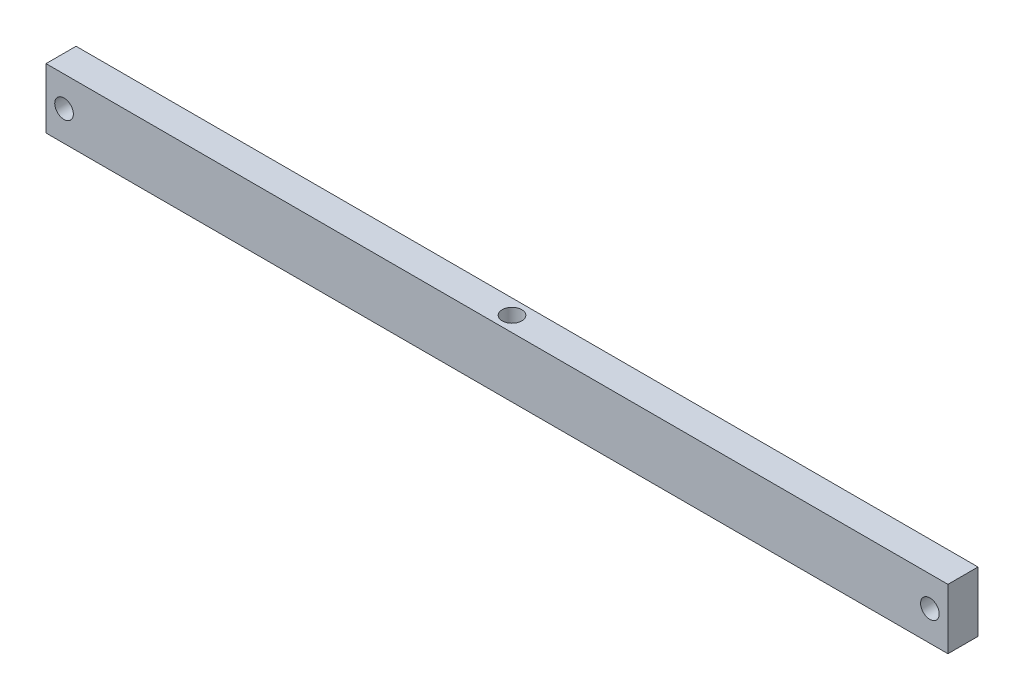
ISO-10303-21;
HEADER;
FILE_DESCRIPTION(('STEP AP214'),'2;1');
FILE_NAME('part.step','',(''),(''),'','','');
FILE_SCHEMA(('AUTOMOTIVE_DESIGN { 1 0 10303 214 1 1 1 1 }'));
ENDSEC;
DATA;
#1=APPLICATION_CONTEXT('core data for automotive mechanical design processes');
#2=APPLICATION_PROTOCOL_DEFINITION('international standard','automotive_design',2000,#1);
#3=PRODUCT_CONTEXT('',#1,'mechanical');
#4=PRODUCT('Part','Part','',(#3));
#5=PRODUCT_RELATED_PRODUCT_CATEGORY('part','',(#4));
#6=PRODUCT_DEFINITION_FORMATION('','',#4);
#7=PRODUCT_DEFINITION_CONTEXT('part definition',#1,'design');
#8=PRODUCT_DEFINITION('design','',#6,#7);
#9=PRODUCT_DEFINITION_SHAPE('','',#8);
#10=(LENGTH_UNIT() NAMED_UNIT(*) SI_UNIT(.MILLI.,.METRE.));
#11=(NAMED_UNIT(*) PLANE_ANGLE_UNIT() SI_UNIT($,.RADIAN.));
#12=(NAMED_UNIT(*) SI_UNIT($,.STERADIAN.) SOLID_ANGLE_UNIT());
#13=UNCERTAINTY_MEASURE_WITH_UNIT(LENGTH_MEASURE(1.E-05),#10,'distance_accuracy_value','');
#14=(GEOMETRIC_REPRESENTATION_CONTEXT(3) GLOBAL_UNCERTAINTY_ASSIGNED_CONTEXT((#13)) GLOBAL_UNIT_ASSIGNED_CONTEXT((#10,
#11,#12)) REPRESENTATION_CONTEXT('',''));
#15=CARTESIAN_POINT('',(0.,0.,0.));
#16=DIRECTION('',(0.,0.,1.));
#17=DIRECTION('',(1.,0.,0.));
#18=AXIS2_PLACEMENT_3D('',#15,#16,#17);
#19=CARTESIAN_POINT('',(-1.11022302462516E-13,0.,5.));
#20=DIRECTION('',(0.,0.,0.999999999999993));
#21=DIRECTION('',(1.,0.,0.));
#22=AXIS2_PLACEMENT_3D('',#19,#20,#21);
#23=PLANE('',#22);
#24=CARTESIAN_POINT('',(6.00000000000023,10.0000000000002,5.));
#25=DIRECTION('',(0.,0.,0.999999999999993));
#26=DIRECTION('',(1.,0.,0.));
#27=AXIS2_PLACEMENT_3D('',#24,#25,#26);
#28=CIRCLE('',#27,3.1);
#29=CARTESIAN_POINT('',(2.90000000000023,10.0000000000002,5.));
#30=VERTEX_POINT('',#29);
#31=EDGE_CURVE('E98',#30,#30,#28,.T.);
#32=ORIENTED_EDGE('',*,*,#31,.F.);
#33=EDGE_LOOP('',(#32));
#34=FACE_BOUND('',#33,.T.);
#35=DIRECTION('',(0.,-1.,0.));
#36=VECTOR('',#35,1.);
#37=CARTESIAN_POINT('',(2.22044604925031E-13,20.,5.));
#38=LINE('',#37,#36);
#39=CARTESIAN_POINT('',(2.22044604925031E-13,20.,5.));
#40=VERTEX_POINT('',#39);
#41=CARTESIAN_POINT('',(-1.11022302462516E-13,0.,5.));
#42=VERTEX_POINT('',#41);
#43=EDGE_CURVE('E113',#40,#42,#38,.T.);
#44=ORIENTED_EDGE('',*,*,#43,.T.);
#45=DIRECTION('',(1.,0.,0.));
#46=VECTOR('',#45,1.);
#47=CARTESIAN_POINT('',(-1.11022302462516E-13,0.,5.));
#48=LINE('',#47,#46);
#49=CARTESIAN_POINT('',(300.,0.,5.00000000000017));
#50=VERTEX_POINT('',#49);
#51=EDGE_CURVE('E92',#42,#50,#48,.T.);
#52=ORIENTED_EDGE('',*,*,#51,.T.);
#53=DIRECTION('',(0.,1.,0.));
#54=VECTOR('',#53,1.);
#55=CARTESIAN_POINT('',(300.,0.,5.00000000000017));
#56=LINE('',#55,#54);
#57=CARTESIAN_POINT('',(300.,20.0000000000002,5.00000000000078));
#58=VERTEX_POINT('',#57);
#59=EDGE_CURVE('E57',#50,#58,#56,.T.);
#60=ORIENTED_EDGE('',*,*,#59,.T.);
#61=DIRECTION('',(-1.,0.,0.));
#62=VECTOR('',#61,1.);
#63=CARTESIAN_POINT('',(300.,20.0000000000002,5.00000000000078));
#64=LINE('',#63,#62);
#65=EDGE_CURVE('E52',#58,#40,#64,.T.);
#66=ORIENTED_EDGE('',*,*,#65,.T.);
#67=EDGE_LOOP('',(#44,#52,#60,#66));
#68=FACE_BOUND('',#67,.T.);
#69=CARTESIAN_POINT('',(294.,10.0000000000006,5.00000000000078));
#70=DIRECTION('',(0.,0.,0.999999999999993));
#71=DIRECTION('',(-1.,0.,0.));
#72=AXIS2_PLACEMENT_3D('',#69,#70,#71);
#73=CIRCLE('',#72,3.09999999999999);
#74=CARTESIAN_POINT('',(290.9,10.0000000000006,5.00000000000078));
#75=VERTEX_POINT('',#74);
#76=EDGE_CURVE('E137',#75,#75,#73,.T.);
#77=ORIENTED_EDGE('',*,*,#76,.F.);
#78=EDGE_LOOP('',(#77));
#79=FACE_BOUND('',#78,.T.);
#80=ADVANCED_FACE('F36',(#34,#68,#79),#23,.T.);
#81=CARTESIAN_POINT('',(-1.11022302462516E-13,0.,-5.));
#82=DIRECTION('',(0.,0.,0.999999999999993));
#83=DIRECTION('',(1.,0.,0.));
#84=AXIS2_PLACEMENT_3D('',#81,#82,#83);
#85=PLANE('',#84);
#86=CARTESIAN_POINT('',(6.00000000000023,10.0000000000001,-5.));
#87=DIRECTION('',(0.,0.,0.999999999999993));
#88=DIRECTION('',(1.,0.,0.));
#89=AXIS2_PLACEMENT_3D('',#86,#87,#88);
#90=CIRCLE('',#89,3.1);
#91=CARTESIAN_POINT('',(2.90000000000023,10.0000000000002,-5.));
#92=VERTEX_POINT('',#91);
#93=EDGE_CURVE('E104',#92,#92,#90,.T.);
#94=ORIENTED_EDGE('',*,*,#93,.T.);
#95=EDGE_LOOP('',(#94));
#96=FACE_BOUND('',#95,.T.);
#97=DIRECTION('',(0.,-1.,0.));
#98=VECTOR('',#97,1.);
#99=CARTESIAN_POINT('',(2.22044604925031E-13,20.,-5.));
#100=LINE('',#99,#98);
#101=CARTESIAN_POINT('',(2.22044604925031E-13,20.,-5.));
#102=VERTEX_POINT('',#101);
#103=CARTESIAN_POINT('',(-1.11022302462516E-13,0.,-5.));
#104=VERTEX_POINT('',#103);
#105=EDGE_CURVE('E83',#102,#104,#100,.T.);
#106=ORIENTED_EDGE('',*,*,#105,.F.);
#107=DIRECTION('',(-1.,0.,0.));
#108=VECTOR('',#107,1.);
#109=CARTESIAN_POINT('',(300.,20.0000000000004,-4.99999999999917));
#110=LINE('',#109,#108);
#111=CARTESIAN_POINT('',(300.,20.0000000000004,-4.99999999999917));
#112=VERTEX_POINT('',#111);
#113=EDGE_CURVE('E110',#112,#102,#110,.T.);
#114=ORIENTED_EDGE('',*,*,#113,.F.);
#115=DIRECTION('',(0.,1.,0.));
#116=VECTOR('',#115,1.);
#117=CARTESIAN_POINT('',(300.,0.,-4.99999999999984));
#118=LINE('',#117,#116);
#119=CARTESIAN_POINT('',(300.,0.,-4.99999999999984));
#120=VERTEX_POINT('',#119);
#121=EDGE_CURVE('E84',#120,#112,#118,.T.);
#122=ORIENTED_EDGE('',*,*,#121,.F.);
#123=DIRECTION('',(1.,0.,0.));
#124=VECTOR('',#123,1.);
#125=CARTESIAN_POINT('',(-1.11022302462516E-13,0.,-5.));
#126=LINE('',#125,#124);
#127=EDGE_CURVE('E78',#104,#120,#126,.T.);
#128=ORIENTED_EDGE('',*,*,#127,.F.);
#129=EDGE_LOOP('',(#106,#114,#122,#128));
#130=FACE_BOUND('',#129,.T.);
#131=CARTESIAN_POINT('',(294.,10.0000000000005,-4.99999999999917));
#132=DIRECTION('',(0.,0.,0.999999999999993));
#133=DIRECTION('',(-1.,0.,0.));
#134=AXIS2_PLACEMENT_3D('',#131,#132,#133);
#135=CIRCLE('',#134,3.09999999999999);
#136=CARTESIAN_POINT('',(290.9,10.0000000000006,-4.99999999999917));
#137=VERTEX_POINT('',#136);
#138=EDGE_CURVE('E140',#137,#137,#135,.T.);
#139=ORIENTED_EDGE('',*,*,#138,.T.);
#140=EDGE_LOOP('',(#139));
#141=FACE_BOUND('',#140,.T.);
#142=ADVANCED_FACE('F79',(#96,#130,#141),#85,.F.);
#143=CARTESIAN_POINT('',(2.22044604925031E-13,20.,5.));
#144=DIRECTION('',(1.,0.,0.));
#145=DIRECTION('',(0.,1.,0.));
#146=AXIS2_PLACEMENT_3D('',#143,#144,#145);
#147=PLANE('',#146);
#148=ORIENTED_EDGE('',*,*,#105,.T.);
#149=DIRECTION('',(0.,0.,-0.999999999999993));
#150=VECTOR('',#149,1.);
#151=CARTESIAN_POINT('',(-1.11022302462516E-13,0.,5.));
#152=LINE('',#151,#150);
#153=EDGE_CURVE('E11',#42,#104,#152,.T.);
#154=ORIENTED_EDGE('',*,*,#153,.F.);
#155=ORIENTED_EDGE('',*,*,#43,.F.);
#156=DIRECTION('',(0.,0.,-0.999999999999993));
#157=VECTOR('',#156,1.);
#158=CARTESIAN_POINT('',(2.22044604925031E-13,20.,5.));
#159=LINE('',#158,#157);
#160=EDGE_CURVE('E96',#40,#102,#159,.T.);
#161=ORIENTED_EDGE('',*,*,#160,.T.);
#162=EDGE_LOOP('',(#148,#154,#155,#161));
#163=FACE_BOUND('',#162,.T.);
#164=ADVANCED_FACE('F38',(#163),#147,.F.);
#165=CARTESIAN_POINT('',(-1.11022302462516E-13,0.,5.));
#166=DIRECTION('',(0.,1.,0.));
#167=DIRECTION('',(0.,0.,0.999999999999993));
#168=AXIS2_PLACEMENT_3D('',#165,#166,#167);
#169=PLANE('',#168);
#170=CARTESIAN_POINT('',(150.,-6.93889390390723E-13,0.));
#171=DIRECTION('',(0.,1.,0.));
#172=DIRECTION('',(0.,0.,0.999999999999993));
#173=AXIS2_PLACEMENT_3D('',#170,#171,#172);
#174=CIRCLE('',#173,3.25000000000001);
#175=CARTESIAN_POINT('',(150.,-6.93889390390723E-13,3.24999999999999));
#176=VERTEX_POINT('',#175);
#177=EDGE_CURVE('E146',#176,#176,#174,.F.);
#178=ORIENTED_EDGE('',*,*,#177,.F.);
#179=EDGE_LOOP('',(#178));
#180=FACE_BOUND('',#179,.T.);
#181=ORIENTED_EDGE('',*,*,#127,.T.);
#182=DIRECTION('',(0.,0.,-0.999999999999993));
#183=VECTOR('',#182,1.);
#184=CARTESIAN_POINT('',(300.,0.,5.00000000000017));
#185=LINE('',#184,#183);
#186=EDGE_CURVE('E45',#50,#120,#185,.T.);
#187=ORIENTED_EDGE('',*,*,#186,.F.);
#188=ORIENTED_EDGE('',*,*,#51,.F.);
#189=ORIENTED_EDGE('',*,*,#153,.T.);
#190=EDGE_LOOP('',(#181,#187,#188,#189));
#191=FACE_BOUND('',#190,.T.);
#192=ADVANCED_FACE('F91',(#180,#191),#169,.F.);
#193=CARTESIAN_POINT('',(300.,0.,5.00000000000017));
#194=DIRECTION('',(-1.,0.,0.));
#195=DIRECTION('',(0.,0.,0.999999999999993));
#196=AXIS2_PLACEMENT_3D('',#193,#194,#195);
#197=PLANE('',#196);
#198=ORIENTED_EDGE('',*,*,#121,.T.);
#199=DIRECTION('',(0.,0.,-0.999999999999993));
#200=VECTOR('',#199,1.);
#201=CARTESIAN_POINT('',(300.,20.0000000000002,5.00000000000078));
#202=LINE('',#201,#200);
#203=EDGE_CURVE('E124',#58,#112,#202,.T.);
#204=ORIENTED_EDGE('',*,*,#203,.F.);
#205=ORIENTED_EDGE('',*,*,#59,.F.);
#206=ORIENTED_EDGE('',*,*,#186,.T.);
#207=EDGE_LOOP('',(#198,#204,#205,#206));
#208=FACE_BOUND('',#207,.T.);
#209=ADVANCED_FACE('F128',(#208),#197,.F.);
#210=CARTESIAN_POINT('',(300.,20.0000000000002,5.00000000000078));
#211=DIRECTION('',(0.,-1.,0.));
#212=DIRECTION('',(0.,0.,-0.999999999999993));
#213=AXIS2_PLACEMENT_3D('',#210,#211,#212);
#214=PLANE('',#213);
#215=CARTESIAN_POINT('',(150.,20.0000000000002,8.32667268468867E-13));
#216=DIRECTION('',(0.,1.,0.));
#217=DIRECTION('',(0.,0.,0.999999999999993));
#218=AXIS2_PLACEMENT_3D('',#215,#216,#217);
#219=CIRCLE('',#218,3.25000000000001);
#220=CARTESIAN_POINT('',(150.,20.0000000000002,3.25000000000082));
#221=VERTEX_POINT('',#220);
#222=EDGE_CURVE('E151',#221,#221,#219,.T.);
#223=ORIENTED_EDGE('',*,*,#222,.F.);
#224=EDGE_LOOP('',(#223));
#225=FACE_BOUND('',#224,.T.);
#226=ORIENTED_EDGE('',*,*,#113,.T.);
#227=ORIENTED_EDGE('',*,*,#160,.F.);
#228=ORIENTED_EDGE('',*,*,#65,.F.);
#229=ORIENTED_EDGE('',*,*,#203,.T.);
#230=EDGE_LOOP('',(#226,#227,#228,#229));
#231=FACE_BOUND('',#230,.T.);
#232=ADVANCED_FACE('F130',(#225,#231),#214,.F.);
#233=CARTESIAN_POINT('',(6.00000000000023,10.0000000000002,5.));
#234=DIRECTION('',(0.,0.,-0.999999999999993));
#235=DIRECTION('',(-1.,0.,0.));
#236=AXIS2_PLACEMENT_3D('',#233,#234,#235);
#237=CYLINDRICAL_SURFACE('',#236,3.1);
#238=CARTESIAN_POINT('',(2.90000000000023,10.0000000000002,5.));
#239=CARTESIAN_POINT('',(2.90000000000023,10.0000000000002,4.89583333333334));
#240=CARTESIAN_POINT('',(2.90000000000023,10.0000000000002,4.79166666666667));
#241=CARTESIAN_POINT('',(2.90000000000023,10.0000000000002,4.58333333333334));
#242=CARTESIAN_POINT('',(2.90000000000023,10.0000000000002,4.47916666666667));
#243=CARTESIAN_POINT('',(2.90000000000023,10.0000000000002,4.27083333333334));
#244=CARTESIAN_POINT('',(2.90000000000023,10.0000000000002,4.16666666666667));
#245=CARTESIAN_POINT('',(2.90000000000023,10.0000000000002,3.95833333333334));
#246=CARTESIAN_POINT('',(2.90000000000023,10.0000000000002,3.85416666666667));
#247=CARTESIAN_POINT('',(2.90000000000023,10.0000000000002,3.64583333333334));
#248=CARTESIAN_POINT('',(2.90000000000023,10.0000000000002,3.54166666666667));
#249=CARTESIAN_POINT('',(2.90000000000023,10.0000000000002,3.33333333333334));
#250=CARTESIAN_POINT('',(2.90000000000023,10.0000000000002,3.22916666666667));
#251=CARTESIAN_POINT('',(2.90000000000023,10.0000000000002,3.02083333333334));
#252=CARTESIAN_POINT('',(2.90000000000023,10.0000000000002,2.91666666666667));
#253=CARTESIAN_POINT('',(2.90000000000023,10.0000000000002,2.70833333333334));
#254=CARTESIAN_POINT('',(2.90000000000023,10.0000000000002,2.60416666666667));
#255=CARTESIAN_POINT('',(2.90000000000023,10.0000000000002,2.39583333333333));
#256=CARTESIAN_POINT('',(2.90000000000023,10.0000000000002,2.29166666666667));
#257=CARTESIAN_POINT('',(2.90000000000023,10.0000000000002,2.08333333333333));
#258=CARTESIAN_POINT('',(2.90000000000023,10.0000000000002,1.97916666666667));
#259=CARTESIAN_POINT('',(2.90000000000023,10.0000000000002,1.77083333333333));
#260=CARTESIAN_POINT('',(2.90000000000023,10.0000000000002,1.66666666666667));
#261=CARTESIAN_POINT('',(2.90000000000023,10.0000000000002,1.45833333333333));
#262=CARTESIAN_POINT('',(2.90000000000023,10.0000000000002,1.35416666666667));
#263=CARTESIAN_POINT('',(2.90000000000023,10.0000000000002,1.14583333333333));
#264=CARTESIAN_POINT('',(2.90000000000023,10.0000000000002,1.04166666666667));
#265=CARTESIAN_POINT('',(2.90000000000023,10.0000000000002,0.833333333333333));
#266=CARTESIAN_POINT('',(2.90000000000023,10.0000000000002,0.729166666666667));
#267=CARTESIAN_POINT('',(2.90000000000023,10.0000000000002,0.520833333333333));
#268=CARTESIAN_POINT('',(2.90000000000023,10.0000000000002,0.416666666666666));
#269=CARTESIAN_POINT('',(2.90000000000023,10.0000000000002,0.208333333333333));
#270=CARTESIAN_POINT('',(2.90000000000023,10.0000000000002,0.104166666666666));
#271=CARTESIAN_POINT('',(2.90000000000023,10.0000000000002,-0.104166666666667));
#272=CARTESIAN_POINT('',(2.90000000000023,10.0000000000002,-0.208333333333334));
#273=CARTESIAN_POINT('',(2.90000000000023,10.0000000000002,-0.416666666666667));
#274=CARTESIAN_POINT('',(2.90000000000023,10.0000000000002,-0.520833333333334));
#275=CARTESIAN_POINT('',(2.90000000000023,10.0000000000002,-0.729166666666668));
#276=CARTESIAN_POINT('',(2.90000000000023,10.0000000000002,-0.833333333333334));
#277=CARTESIAN_POINT('',(2.90000000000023,10.0000000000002,-1.04166666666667));
#278=CARTESIAN_POINT('',(2.90000000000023,10.0000000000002,-1.14583333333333));
#279=CARTESIAN_POINT('',(2.90000000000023,10.0000000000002,-1.35416666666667));
#280=CARTESIAN_POINT('',(2.90000000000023,10.0000000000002,-1.45833333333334));
#281=CARTESIAN_POINT('',(2.90000000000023,10.0000000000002,-1.66666666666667));
#282=CARTESIAN_POINT('',(2.90000000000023,10.0000000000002,-1.77083333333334));
#283=CARTESIAN_POINT('',(2.90000000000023,10.0000000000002,-1.97916666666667));
#284=CARTESIAN_POINT('',(2.90000000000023,10.0000000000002,-2.08333333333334));
#285=CARTESIAN_POINT('',(2.90000000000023,10.0000000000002,-2.29166666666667));
#286=CARTESIAN_POINT('',(2.90000000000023,10.0000000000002,-2.39583333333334));
#287=CARTESIAN_POINT('',(2.90000000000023,10.0000000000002,-2.60416666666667));
#288=CARTESIAN_POINT('',(2.90000000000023,10.0000000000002,-2.70833333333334));
#289=CARTESIAN_POINT('',(2.90000000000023,10.0000000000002,-2.91666666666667));
#290=CARTESIAN_POINT('',(2.90000000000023,10.0000000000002,-3.02083333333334));
#291=CARTESIAN_POINT('',(2.90000000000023,10.0000000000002,-3.22916666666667));
#292=CARTESIAN_POINT('',(2.90000000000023,10.0000000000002,-3.33333333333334));
#293=CARTESIAN_POINT('',(2.90000000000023,10.0000000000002,-3.54166666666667));
#294=CARTESIAN_POINT('',(2.90000000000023,10.0000000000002,-3.64583333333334));
#295=CARTESIAN_POINT('',(2.90000000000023,10.0000000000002,-3.85416666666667));
#296=CARTESIAN_POINT('',(2.90000000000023,10.0000000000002,-3.95833333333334));
#297=CARTESIAN_POINT('',(2.90000000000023,10.0000000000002,-4.16666666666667));
#298=CARTESIAN_POINT('',(2.90000000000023,10.0000000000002,-4.27083333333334));
#299=CARTESIAN_POINT('',(2.90000000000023,10.0000000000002,-4.47916666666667));
#300=CARTESIAN_POINT('',(2.90000000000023,10.0000000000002,-4.58333333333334));
#301=CARTESIAN_POINT('',(2.90000000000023,10.0000000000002,-4.79166666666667));
#302=CARTESIAN_POINT('',(2.90000000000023,10.0000000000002,-4.89583333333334));
#303=CARTESIAN_POINT('',(2.90000000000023,10.0000000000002,-5.));
#304=B_SPLINE_CURVE_WITH_KNOTS('',3,(#238,#239,#240,#241,#242,#243,#244,#245,#246,#247,#248,
#249,#250,#251,#252,#253,#254,#255,#256,#257,#258,#259,#260,#261,#262,#263,#264,#265,#266,#267,
#268,#269,#270,#271,#272,#273,#274,#275,#276,#277,#278,#279,#280,#281,#282,#283,#284,#285,#286,
#287,#288,#289,#290,#291,#292,#293,#294,#295,#296,#297,#298,#299,#300,#301,#302,#303),
.UNSPECIFIED.,.F.,.F.,(4,2,2,2,2,2,2,2,2,2,2,2,2,2,2,2,2,2,2,2,2,2,2,2,2,2,2,2,2,2,2,2,4),(0.,
0.312499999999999,0.625,0.9375,1.25,1.5625,1.875,2.1875,2.5,2.8125,3.125,3.4375,3.75,4.0625,
4.375,4.6875,5.,5.3125,5.62500000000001,5.9375,6.25000000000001,6.56250000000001,
6.87500000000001,7.18750000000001,7.50000000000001,7.81250000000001,8.12500000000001,
8.43750000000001,8.75000000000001,9.06250000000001,9.37500000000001,9.68750000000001,10.),.UNSPECIFIED.);
#305=EDGE_CURVE('BSEAM160',#30,#92,#304,.T.);
#306=ORIENTED_EDGE('',*,*,#31,.T.);
#307=ORIENTED_EDGE('',*,*,#93,.F.);
#308=ORIENTED_EDGE('',*,*,#305,.T.);
#309=ORIENTED_EDGE('',*,*,#305,.F.);
#310=EDGE_LOOP('',(#306,#308,#307,#309));
#311=FACE_BOUND('',#310,.T.);
#312=ADVANCED_FACE('F160',(#311),#237,.F.);
#313=CARTESIAN_POINT('',(294.,10.0000000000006,5.00000000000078));
#314=DIRECTION('',(0.,0.,-0.999999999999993));
#315=DIRECTION('',(-1.,0.,0.));
#316=AXIS2_PLACEMENT_3D('',#313,#314,#315);
#317=CYLINDRICAL_SURFACE('',#316,3.09999999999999);
#318=CARTESIAN_POINT('',(290.9,10.0000000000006,5.00000000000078));
#319=CARTESIAN_POINT('',(290.9,10.0000000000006,4.89583333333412));
#320=CARTESIAN_POINT('',(290.9,10.0000000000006,4.79166666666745));
#321=CARTESIAN_POINT('',(290.9,10.0000000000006,4.58333333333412));
#322=CARTESIAN_POINT('',(290.9,10.0000000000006,4.47916666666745));
#323=CARTESIAN_POINT('',(290.9,10.0000000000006,4.27083333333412));
#324=CARTESIAN_POINT('',(290.9,10.0000000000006,4.16666666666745));
#325=CARTESIAN_POINT('',(290.9,10.0000000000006,3.95833333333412));
#326=CARTESIAN_POINT('',(290.9,10.0000000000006,3.85416666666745));
#327=CARTESIAN_POINT('',(290.9,10.0000000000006,3.64583333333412));
#328=CARTESIAN_POINT('',(290.9,10.0000000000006,3.54166666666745));
#329=CARTESIAN_POINT('',(290.9,10.0000000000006,3.33333333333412));
#330=CARTESIAN_POINT('',(290.9,10.0000000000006,3.22916666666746));
#331=CARTESIAN_POINT('',(290.9,10.0000000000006,3.02083333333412));
#332=CARTESIAN_POINT('',(290.9,10.0000000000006,2.91666666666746));
#333=CARTESIAN_POINT('',(290.9,10.0000000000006,2.70833333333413));
#334=CARTESIAN_POINT('',(290.9,10.0000000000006,2.60416666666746));
#335=CARTESIAN_POINT('',(290.9,10.0000000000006,2.39583333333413));
#336=CARTESIAN_POINT('',(290.9,10.0000000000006,2.29166666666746));
#337=CARTESIAN_POINT('',(290.9,10.0000000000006,2.08333333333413));
#338=CARTESIAN_POINT('',(290.9,10.0000000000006,1.97916666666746));
#339=CARTESIAN_POINT('',(290.9,10.0000000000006,1.77083333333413));
#340=CARTESIAN_POINT('',(290.9,10.0000000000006,1.66666666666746));
#341=CARTESIAN_POINT('',(290.9,10.0000000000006,1.45833333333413));
#342=CARTESIAN_POINT('',(290.9,10.0000000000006,1.35416666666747));
#343=CARTESIAN_POINT('',(290.9,10.0000000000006,1.14583333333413));
#344=CARTESIAN_POINT('',(290.9,10.0000000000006,1.04166666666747));
#345=CARTESIAN_POINT('',(290.9,10.0000000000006,0.833333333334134));
#346=CARTESIAN_POINT('',(290.9,10.0000000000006,0.729166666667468));
#347=CARTESIAN_POINT('',(290.9,10.0000000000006,0.520833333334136));
#348=CARTESIAN_POINT('',(290.9,10.0000000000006,0.416666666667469));
#349=CARTESIAN_POINT('',(290.9,10.0000000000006,0.208333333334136));
#350=CARTESIAN_POINT('',(290.9,10.0000000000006,0.10416666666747));
#351=CARTESIAN_POINT('',(290.9,10.0000000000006,-0.104166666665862));
#352=CARTESIAN_POINT('',(290.9,10.0000000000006,-0.208333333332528));
#353=CARTESIAN_POINT('',(290.9,10.0000000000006,-0.41666666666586));
#354=CARTESIAN_POINT('',(290.9,10.0000000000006,-0.520833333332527));
#355=CARTESIAN_POINT('',(290.9,10.0000000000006,-0.729166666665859));
#356=CARTESIAN_POINT('',(290.9,10.0000000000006,-0.833333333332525));
#357=CARTESIAN_POINT('',(290.9,10.0000000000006,-1.04166666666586));
#358=CARTESIAN_POINT('',(290.9,10.0000000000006,-1.14583333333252));
#359=CARTESIAN_POINT('',(290.9,10.0000000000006,-1.35416666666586));
#360=CARTESIAN_POINT('',(290.9,10.0000000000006,-1.45833333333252));
#361=CARTESIAN_POINT('',(290.9,10.0000000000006,-1.66666666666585));
#362=CARTESIAN_POINT('',(290.9,10.0000000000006,-1.77083333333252));
#363=CARTESIAN_POINT('',(290.9,10.0000000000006,-1.97916666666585));
#364=CARTESIAN_POINT('',(290.9,10.0000000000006,-2.08333333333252));
#365=CARTESIAN_POINT('',(290.9,10.0000000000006,-2.29166666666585));
#366=CARTESIAN_POINT('',(290.9,10.0000000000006,-2.39583333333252));
#367=CARTESIAN_POINT('',(290.9,10.0000000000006,-2.60416666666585));
#368=CARTESIAN_POINT('',(290.9,10.0000000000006,-2.70833333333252));
#369=CARTESIAN_POINT('',(290.9,10.0000000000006,-2.91666666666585));
#370=CARTESIAN_POINT('',(290.9,10.0000000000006,-3.02083333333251));
#371=CARTESIAN_POINT('',(290.9,10.0000000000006,-3.22916666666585));
#372=CARTESIAN_POINT('',(290.9,10.0000000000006,-3.33333333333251));
#373=CARTESIAN_POINT('',(290.9,10.0000000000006,-3.54166666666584));
#374=CARTESIAN_POINT('',(290.9,10.0000000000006,-3.64583333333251));
#375=CARTESIAN_POINT('',(290.9,10.0000000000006,-3.85416666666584));
#376=CARTESIAN_POINT('',(290.9,10.0000000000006,-3.95833333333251));
#377=CARTESIAN_POINT('',(290.9,10.0000000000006,-4.16666666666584));
#378=CARTESIAN_POINT('',(290.9,10.0000000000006,-4.27083333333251));
#379=CARTESIAN_POINT('',(290.9,10.0000000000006,-4.47916666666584));
#380=CARTESIAN_POINT('',(290.9,10.0000000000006,-4.58333333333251));
#381=CARTESIAN_POINT('',(290.9,10.0000000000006,-4.79166666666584));
#382=CARTESIAN_POINT('',(290.9,10.0000000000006,-4.89583333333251));
#383=CARTESIAN_POINT('',(290.9,10.0000000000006,-4.99999999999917));
#384=B_SPLINE_CURVE_WITH_KNOTS('',3,(#318,#319,#320,#321,#322,#323,#324,#325,#326,#327,#328,
#329,#330,#331,#332,#333,#334,#335,#336,#337,#338,#339,#340,#341,#342,#343,#344,#345,#346,#347,
#348,#349,#350,#351,#352,#353,#354,#355,#356,#357,#358,#359,#360,#361,#362,#363,#364,#365,#366,
#367,#368,#369,#370,#371,#372,#373,#374,#375,#376,#377,#378,#379,#380,#381,#382,#383),
.UNSPECIFIED.,.F.,.F.,(4,2,2,2,2,2,2,2,2,2,2,2,2,2,2,2,2,2,2,2,2,2,2,2,2,2,2,2,2,2,2,2,4),(0.,
0.312499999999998,0.624999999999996,0.937499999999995,1.24999999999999,1.56249999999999,
1.87499999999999,2.18749999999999,2.49999999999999,2.81249999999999,3.12499999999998,
3.43749999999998,3.74999999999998,4.06249999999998,4.37499999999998,4.68749999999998,
4.99999999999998,5.31249999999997,5.62499999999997,5.93749999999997,6.24999999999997,
6.56249999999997,6.87499999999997,7.18749999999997,7.49999999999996,7.81249999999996,
8.12499999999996,8.43749999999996,8.74999999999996,9.06249999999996,9.37499999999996,
9.68749999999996,9.99999999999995),.UNSPECIFIED.);
#385=EDGE_CURVE('BSEAM166',#75,#137,#384,.T.);
#386=ORIENTED_EDGE('',*,*,#76,.T.);
#387=ORIENTED_EDGE('',*,*,#138,.F.);
#388=ORIENTED_EDGE('',*,*,#385,.T.);
#389=ORIENTED_EDGE('',*,*,#385,.F.);
#390=EDGE_LOOP('',(#386,#388,#387,#389));
#391=FACE_BOUND('',#390,.T.);
#392=ADVANCED_FACE('F166',(#391),#317,.F.);
#393=CARTESIAN_POINT('',(150.,-0.0009999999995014,0.));
#394=DIRECTION('',(0.,1.,0.));
#395=DIRECTION('',(0.,0.,0.999999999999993));
#396=AXIS2_PLACEMENT_3D('',#393,#394,#395);
#397=CYLINDRICAL_SURFACE('',#396,3.25000000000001);
#398=ORIENTED_EDGE('',*,*,#222,.T.);
#399=EDGE_LOOP('',(#398));
#400=FACE_BOUND('',#399,.T.);
#401=ORIENTED_EDGE('',*,*,#177,.T.);
#402=EDGE_LOOP('',(#401));
#403=FACE_BOUND('',#402,.T.);
#404=ADVANCED_FACE('F156',(#400,#403),#397,.F.);
#405=CLOSED_SHELL('',(#80,#142,#164,#192,#209,#232,#312,#392,#404));
#406=MANIFOLD_SOLID_BREP('B2',#405);
#407=ADVANCED_BREP_SHAPE_REPRESENTATION('',(#18,#406),#14);
#408=SHAPE_DEFINITION_REPRESENTATION(#9,#407);
ENDSEC;
END-ISO-10303-21;
